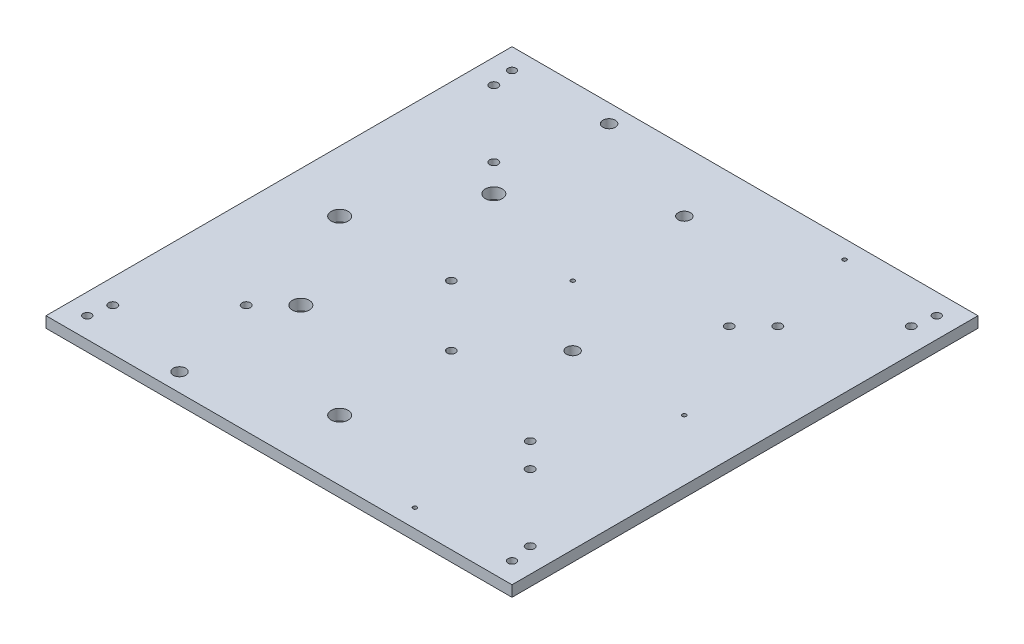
ISO-10303-21;
HEADER;
FILE_DESCRIPTION(('STEP AP214'),'2;1');
FILE_NAME('part.step','',(''),(''),'','','');
FILE_SCHEMA(('AUTOMOTIVE_DESIGN { 1 0 10303 214 1 1 1 1 }'));
ENDSEC;
DATA;
#1=APPLICATION_CONTEXT('core data for automotive mechanical design processes');
#2=APPLICATION_PROTOCOL_DEFINITION('international standard','automotive_design',2000,#1);
#3=PRODUCT_CONTEXT('',#1,'mechanical');
#4=PRODUCT('Part','Part','',(#3));
#5=PRODUCT_RELATED_PRODUCT_CATEGORY('part','',(#4));
#6=PRODUCT_DEFINITION_FORMATION('','',#4);
#7=PRODUCT_DEFINITION_CONTEXT('part definition',#1,'design');
#8=PRODUCT_DEFINITION('design','',#6,#7);
#9=PRODUCT_DEFINITION_SHAPE('','',#8);
#10=(LENGTH_UNIT() NAMED_UNIT(*) SI_UNIT(.MILLI.,.METRE.));
#11=(NAMED_UNIT(*) PLANE_ANGLE_UNIT() SI_UNIT($,.RADIAN.));
#12=(NAMED_UNIT(*) SI_UNIT($,.STERADIAN.) SOLID_ANGLE_UNIT());
#13=UNCERTAINTY_MEASURE_WITH_UNIT(LENGTH_MEASURE(1.E-05),#10,'distance_accuracy_value','');
#14=(GEOMETRIC_REPRESENTATION_CONTEXT(3) GLOBAL_UNCERTAINTY_ASSIGNED_CONTEXT((#13)) GLOBAL_UNIT_ASSIGNED_CONTEXT((#10,
#11,#12)) REPRESENTATION_CONTEXT('',''));
#15=CARTESIAN_POINT('',(0.,0.,0.));
#16=DIRECTION('',(0.,0.,1.));
#17=DIRECTION('',(1.,0.,0.));
#18=AXIS2_PLACEMENT_3D('',#15,#16,#17);
#19=CARTESIAN_POINT('',(0.,0.,0.));
#20=DIRECTION('',(0.,-1.,0.));
#21=DIRECTION('',(0.,0.,-1.));
#22=AXIS2_PLACEMENT_3D('',#19,#20,#21);
#23=PLANE('',#22);
#24=CARTESIAN_POINT('',(50.,0.,-192.));
#25=DIRECTION('',(0.,1.,0.));
#26=DIRECTION('',(0.,0.,1.));
#27=AXIS2_PLACEMENT_3D('',#24,#25,#26);
#28=CIRCLE('',#27,7.);
#29=CARTESIAN_POINT('',(50.,0.,-185.));
#30=VERTEX_POINT('',#29);
#31=EDGE_CURVE('E289',#30,#30,#28,.T.);
#32=ORIENTED_EDGE('',*,*,#31,.T.);
#33=EDGE_LOOP('',(#32));
#34=FACE_BOUND('',#33,.T.);
#35=CARTESIAN_POINT('',(97.5,0.,-271.5));
#36=DIRECTION('',(0.,1.,0.));
#37=DIRECTION('',(0.,0.,1.));
#38=AXIS2_PLACEMENT_3D('',#35,#36,#37);
#39=CIRCLE('',#38,6.99999999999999);
#40=CARTESIAN_POINT('',(97.5,0.,-264.5));
#41=VERTEX_POINT('',#40);
#42=EDGE_CURVE('E281',#41,#41,#39,.T.);
#43=ORIENTED_EDGE('',*,*,#42,.T.);
#44=EDGE_LOOP('',(#43));
#45=FACE_BOUND('',#44,.T.);
#46=CARTESIAN_POINT('',(192.,0.,-50.));
#47=DIRECTION('',(0.,1.,0.));
#48=DIRECTION('',(0.,0.,1.));
#49=AXIS2_PLACEMENT_3D('',#46,#47,#48);
#50=CIRCLE('',#49,7.00000000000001);
#51=CARTESIAN_POINT('',(192.,0.,-43.));
#52=VERTEX_POINT('',#51);
#53=EDGE_CURVE('E273',#52,#52,#50,.T.);
#54=ORIENTED_EDGE('',*,*,#53,.T.);
#55=EDGE_LOOP('',(#54));
#56=FACE_BOUND('',#55,.T.);
#57=CARTESIAN_POINT('',(97.5,0.,-112.5));
#58=DIRECTION('',(0.,1.,0.));
#59=DIRECTION('',(0.,0.,1.));
#60=AXIS2_PLACEMENT_3D('',#57,#58,#59);
#61=CIRCLE('',#60,6.99999999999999);
#62=CARTESIAN_POINT('',(97.5,0.,-105.5));
#63=VERTEX_POINT('',#62);
#64=EDGE_CURVE('E265',#63,#63,#61,.T.);
#65=ORIENTED_EDGE('',*,*,#64,.T.);
#66=EDGE_LOOP('',(#65));
#67=FACE_BOUND('',#66,.T.);
#68=CARTESIAN_POINT('',(242.,0.,-192.));
#69=DIRECTION('',(0.,1.,0.));
#70=DIRECTION('',(0.,0.,1.));
#71=AXIS2_PLACEMENT_3D('',#68,#69,#70);
#72=CIRCLE('',#71,5.09999999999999);
#73=CARTESIAN_POINT('',(242.,0.,-186.9));
#74=VERTEX_POINT('',#73);
#75=EDGE_CURVE('E257',#74,#74,#72,.T.);
#76=ORIENTED_EDGE('',*,*,#75,.T.);
#77=EDGE_LOOP('',(#76));
#78=FACE_BOUND('',#77,.T.);
#79=CARTESIAN_POINT('',(192.,0.,-334.));
#80=DIRECTION('',(0.,1.,0.));
#81=DIRECTION('',(0.,0.,1.));
#82=AXIS2_PLACEMENT_3D('',#79,#80,#81);
#83=CIRCLE('',#82,5.09999999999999);
#84=CARTESIAN_POINT('',(192.,0.,-328.9));
#85=VERTEX_POINT('',#84);
#86=EDGE_CURVE('E249',#85,#85,#83,.T.);
#87=ORIENTED_EDGE('',*,*,#86,.T.);
#88=EDGE_LOOP('',(#87));
#89=FACE_BOUND('',#88,.T.);
#90=CARTESIAN_POINT('',(95.,0.,-369.));
#91=DIRECTION('',(0.,1.,0.));
#92=DIRECTION('',(0.,0.,1.));
#93=AXIS2_PLACEMENT_3D('',#90,#91,#92);
#94=CIRCLE('',#93,5.09999999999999);
#95=CARTESIAN_POINT('',(95.,0.,-363.9));
#96=VERTEX_POINT('',#95);
#97=EDGE_CURVE('E241',#96,#96,#94,.T.);
#98=ORIENTED_EDGE('',*,*,#97,.T.);
#99=EDGE_LOOP('',(#98));
#100=FACE_BOUND('',#99,.T.);
#101=CARTESIAN_POINT('',(95.,0.,-15.));
#102=DIRECTION('',(0.,1.,0.));
#103=DIRECTION('',(0.,0.,1.));
#104=AXIS2_PLACEMENT_3D('',#101,#102,#103);
#105=CIRCLE('',#104,5.09999999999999);
#106=CARTESIAN_POINT('',(95.,0.,-9.90000000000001));
#107=VERTEX_POINT('',#106);
#108=EDGE_CURVE('E233',#107,#107,#105,.T.);
#109=ORIENTED_EDGE('',*,*,#108,.T.);
#110=EDGE_LOOP('',(#109));
#111=FACE_BOUND('',#110,.T.);
#112=CARTESIAN_POINT('',(192.,0.,-242.));
#113=DIRECTION('',(0.,1.,0.));
#114=DIRECTION('',(0.,0.,1.));
#115=AXIS2_PLACEMENT_3D('',#112,#113,#114);
#116=CIRCLE('',#115,1.64999999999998);
#117=CARTESIAN_POINT('',(192.,0.,-240.35));
#118=VERTEX_POINT('',#117);
#119=EDGE_CURVE('E225',#118,#118,#116,.T.);
#120=ORIENTED_EDGE('',*,*,#119,.T.);
#121=EDGE_LOOP('',(#120));
#122=FACE_BOUND('',#121,.T.);
#123=CARTESIAN_POINT('',(334.,0.,-192.));
#124=DIRECTION('',(0.,1.,0.));
#125=DIRECTION('',(0.,0.,1.));
#126=AXIS2_PLACEMENT_3D('',#123,#124,#125);
#127=CIRCLE('',#126,1.64999999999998);
#128=CARTESIAN_POINT('',(334.,0.,-190.35));
#129=VERTEX_POINT('',#128);
#130=EDGE_CURVE('E217',#129,#129,#127,.T.);
#131=ORIENTED_EDGE('',*,*,#130,.T.);
#132=EDGE_LOOP('',(#131));
#133=FACE_BOUND('',#132,.T.);
#134=CARTESIAN_POINT('',(289.,0.,-369.));
#135=DIRECTION('',(0.,1.,0.));
#136=DIRECTION('',(0.,0.,1.));
#137=AXIS2_PLACEMENT_3D('',#134,#135,#136);
#138=CIRCLE('',#137,1.64999999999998);
#139=CARTESIAN_POINT('',(289.,0.,-367.35));
#140=VERTEX_POINT('',#139);
#141=EDGE_CURVE('E209',#140,#140,#138,.T.);
#142=ORIENTED_EDGE('',*,*,#141,.T.);
#143=EDGE_LOOP('',(#142));
#144=FACE_BOUND('',#143,.T.);
#145=CARTESIAN_POINT('',(289.,0.,-15.));
#146=DIRECTION('',(0.,1.,0.));
#147=DIRECTION('',(0.,0.,1.));
#148=AXIS2_PLACEMENT_3D('',#145,#146,#147);
#149=CIRCLE('',#148,1.64999999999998);
#150=CARTESIAN_POINT('',(289.,0.,-13.35));
#151=VERTEX_POINT('',#150);
#152=EDGE_CURVE('E201',#151,#151,#149,.T.);
#153=ORIENTED_EDGE('',*,*,#152,.T.);
#154=EDGE_LOOP('',(#153));
#155=FACE_BOUND('',#154,.T.);
#156=CARTESIAN_POINT('',(142.,0.,-192.));
#157=DIRECTION('',(0.,1.,0.));
#158=DIRECTION('',(0.,0.,1.));
#159=AXIS2_PLACEMENT_3D('',#156,#157,#158);
#160=CIRCLE('',#159,3.39999999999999);
#161=CARTESIAN_POINT('',(142.,0.,-188.6));
#162=VERTEX_POINT('',#161);
#163=EDGE_CURVE('E193',#162,#162,#160,.T.);
#164=ORIENTED_EDGE('',*,*,#163,.T.);
#165=EDGE_LOOP('',(#164));
#166=FACE_BOUND('',#165,.T.);
#167=CARTESIAN_POINT('',(289.,0.,-110.));
#168=DIRECTION('',(0.,1.,0.));
#169=DIRECTION('',(0.,0.,1.));
#170=AXIS2_PLACEMENT_3D('',#167,#168,#169);
#171=CIRCLE('',#170,3.40000000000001);
#172=CARTESIAN_POINT('',(289.,0.,-106.6));
#173=VERTEX_POINT('',#172);
#174=EDGE_CURVE('E185',#173,#173,#171,.T.);
#175=ORIENTED_EDGE('',*,*,#174,.T.);
#176=EDGE_LOOP('',(#175));
#177=FACE_BOUND('',#176,.T.);
#178=CARTESIAN_POINT('',(289.,0.,-274.));
#179=DIRECTION('',(0.,1.,0.));
#180=DIRECTION('',(0.,0.,1.));
#181=AXIS2_PLACEMENT_3D('',#178,#179,#180);
#182=CIRCLE('',#181,3.40000000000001);
#183=CARTESIAN_POINT('',(289.,0.,-270.6));
#184=VERTEX_POINT('',#183);
#185=EDGE_CURVE('E177',#184,#184,#182,.T.);
#186=ORIENTED_EDGE('',*,*,#185,.T.);
#187=EDGE_LOOP('',(#186));
#188=FACE_BOUND('',#187,.T.);
#189=CARTESIAN_POINT('',(192.,0.,-142.));
#190=DIRECTION('',(0.,1.,0.));
#191=DIRECTION('',(0.,0.,1.));
#192=AXIS2_PLACEMENT_3D('',#189,#190,#191);
#193=CIRCLE('',#192,3.39999999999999);
#194=CARTESIAN_POINT('',(192.,0.,-138.6));
#195=VERTEX_POINT('',#194);
#196=EDGE_CURVE('E169',#195,#195,#193,.T.);
#197=ORIENTED_EDGE('',*,*,#196,.T.);
#198=EDGE_LOOP('',(#197));
#199=FACE_BOUND('',#198,.T.);
#200=CARTESIAN_POINT('',(17.,0.,-17.));
#201=DIRECTION('',(0.,-1.,0.));
#202=DIRECTION('',(0.,0.,-1.));
#203=AXIS2_PLACEMENT_3D('',#200,#201,#202);
#204=CIRCLE('',#203,3.29999999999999);
#205=CARTESIAN_POINT('',(17.,0.,-20.3));
#206=VERTEX_POINT('',#205);
#207=EDGE_CURVE('E161',#206,#206,#204,.T.);
#208=ORIENTED_EDGE('',*,*,#207,.F.);
#209=EDGE_LOOP('',(#208));
#210=FACE_BOUND('',#209,.T.);
#211=CARTESIAN_POINT('',(17.,0.,-367.));
#212=DIRECTION('',(0.,-1.,0.));
#213=DIRECTION('',(0.,0.,-1.));
#214=AXIS2_PLACEMENT_3D('',#211,#212,#213);
#215=CIRCLE('',#214,3.29999999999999);
#216=CARTESIAN_POINT('',(17.,0.,-370.3));
#217=VERTEX_POINT('',#216);
#218=EDGE_CURVE('E153',#217,#217,#215,.T.);
#219=ORIENTED_EDGE('',*,*,#218,.F.);
#220=EDGE_LOOP('',(#219));
#221=FACE_BOUND('',#220,.T.);
#222=CARTESIAN_POINT('',(367.,0.,-367.));
#223=DIRECTION('',(0.,-1.,0.));
#224=DIRECTION('',(0.,0.,-1.));
#225=AXIS2_PLACEMENT_3D('',#222,#223,#224);
#226=CIRCLE('',#225,3.3);
#227=CARTESIAN_POINT('',(367.,0.,-370.3));
#228=VERTEX_POINT('',#227);
#229=EDGE_CURVE('E145',#228,#228,#226,.T.);
#230=ORIENTED_EDGE('',*,*,#229,.F.);
#231=EDGE_LOOP('',(#230));
#232=FACE_BOUND('',#231,.T.);
#233=CARTESIAN_POINT('',(367.,0.,-17.));
#234=DIRECTION('',(0.,-1.,0.));
#235=DIRECTION('',(0.,0.,-1.));
#236=AXIS2_PLACEMENT_3D('',#233,#234,#235);
#237=CIRCLE('',#236,3.3);
#238=CARTESIAN_POINT('',(367.,0.,-20.3));
#239=VERTEX_POINT('',#238);
#240=EDGE_CURVE('E121',#239,#239,#237,.T.);
#241=ORIENTED_EDGE('',*,*,#240,.F.);
#242=EDGE_LOOP('',(#241));
#243=FACE_BOUND('',#242,.T.);
#244=DIRECTION('',(0.,0.,1.));
#245=VECTOR('',#244,1.);
#246=CARTESIAN_POINT('',(0.,0.,0.));
#247=LINE('',#246,#245);
#248=CARTESIAN_POINT('',(0.,0.,-384.));
#249=VERTEX_POINT('',#248);
#250=CARTESIAN_POINT('',(0.,0.,0.));
#251=VERTEX_POINT('',#250);
#252=EDGE_CURVE('E117',#249,#251,#247,.T.);
#253=ORIENTED_EDGE('',*,*,#252,.F.);
#254=DIRECTION('',(-1.,0.,0.));
#255=VECTOR('',#254,1.);
#256=CARTESIAN_POINT('',(0.,0.,-384.));
#257=LINE('',#256,#255);
#258=CARTESIAN_POINT('',(384.,0.,-384.));
#259=VERTEX_POINT('',#258);
#260=EDGE_CURVE('E88',#259,#249,#257,.T.);
#261=ORIENTED_EDGE('',*,*,#260,.F.);
#262=DIRECTION('',(0.,0.,-1.));
#263=VECTOR('',#262,1.);
#264=CARTESIAN_POINT('',(384.,0.,0.));
#265=LINE('',#264,#263);
#266=CARTESIAN_POINT('',(384.,0.,0.));
#267=VERTEX_POINT('',#266);
#268=EDGE_CURVE('E82',#267,#259,#265,.T.);
#269=ORIENTED_EDGE('',*,*,#268,.F.);
#270=DIRECTION('',(1.,0.,0.));
#271=VECTOR('',#270,1.);
#272=CARTESIAN_POINT('',(0.,0.,0.));
#273=LINE('',#272,#271);
#274=EDGE_CURVE('E106',#251,#267,#273,.T.);
#275=ORIENTED_EDGE('',*,*,#274,.F.);
#276=EDGE_LOOP('',(#253,#261,#269,#275));
#277=FACE_BOUND('',#276,.T.);
#278=CARTESIAN_POINT('',(75.0000000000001,0.,-90.));
#279=DIRECTION('',(0.,1.,0.));
#280=DIRECTION('',(0.,0.,1.));
#281=AXIS2_PLACEMENT_3D('',#278,#279,#280);
#282=CIRCLE('',#281,3.5);
#283=CARTESIAN_POINT('',(75.0000000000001,0.,-86.5));
#284=VERTEX_POINT('',#283);
#285=EDGE_CURVE('E297',#284,#284,#282,.T.);
#286=ORIENTED_EDGE('',*,*,#285,.T.);
#287=EDGE_LOOP('',(#286));
#288=FACE_BOUND('',#287,.T.);
#289=CARTESIAN_POINT('',(20.0000000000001,0.,-35.));
#290=DIRECTION('',(0.,1.,0.));
#291=DIRECTION('',(0.,0.,1.));
#292=AXIS2_PLACEMENT_3D('',#289,#290,#291);
#293=CIRCLE('',#292,3.5);
#294=CARTESIAN_POINT('',(20.0000000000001,0.,-31.5));
#295=VERTEX_POINT('',#294);
#296=EDGE_CURVE('E305',#295,#295,#293,.T.);
#297=ORIENTED_EDGE('',*,*,#296,.T.);
#298=EDGE_LOOP('',(#297));
#299=FACE_BOUND('',#298,.T.);
#300=CARTESIAN_POINT('',(309.,0.,-90.0000000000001));
#301=DIRECTION('',(0.,1.,0.));
#302=DIRECTION('',(0.,0.,1.));
#303=AXIS2_PLACEMENT_3D('',#300,#301,#302);
#304=CIRCLE('',#303,3.5);
#305=CARTESIAN_POINT('',(309.,0.,-86.5));
#306=VERTEX_POINT('',#305);
#307=EDGE_CURVE('E313',#306,#306,#304,.T.);
#308=ORIENTED_EDGE('',*,*,#307,.T.);
#309=EDGE_LOOP('',(#308));
#310=FACE_BOUND('',#309,.T.);
#311=CARTESIAN_POINT('',(364.,0.,-35.0000000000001));
#312=DIRECTION('',(0.,1.,0.));
#313=DIRECTION('',(0.,0.,1.));
#314=AXIS2_PLACEMENT_3D('',#311,#312,#313);
#315=CIRCLE('',#314,3.5);
#316=CARTESIAN_POINT('',(364.,0.,-31.5000000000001));
#317=VERTEX_POINT('',#316);
#318=EDGE_CURVE('E321',#317,#317,#315,.T.);
#319=ORIENTED_EDGE('',*,*,#318,.T.);
#320=EDGE_LOOP('',(#319));
#321=FACE_BOUND('',#320,.T.);
#322=CARTESIAN_POINT('',(309.,0.,-294.));
#323=DIRECTION('',(0.,1.,0.));
#324=DIRECTION('',(0.,0.,1.));
#325=AXIS2_PLACEMENT_3D('',#322,#323,#324);
#326=CIRCLE('',#325,3.5);
#327=CARTESIAN_POINT('',(309.,0.,-290.5));
#328=VERTEX_POINT('',#327);
#329=EDGE_CURVE('E329',#328,#328,#326,.T.);
#330=ORIENTED_EDGE('',*,*,#329,.T.);
#331=EDGE_LOOP('',(#330));
#332=FACE_BOUND('',#331,.T.);
#333=CARTESIAN_POINT('',(364.,0.,-349.));
#334=DIRECTION('',(0.,1.,0.));
#335=DIRECTION('',(0.,0.,1.));
#336=AXIS2_PLACEMENT_3D('',#333,#334,#335);
#337=CIRCLE('',#336,3.5);
#338=CARTESIAN_POINT('',(364.,0.,-345.5));
#339=VERTEX_POINT('',#338);
#340=EDGE_CURVE('E337',#339,#339,#337,.T.);
#341=ORIENTED_EDGE('',*,*,#340,.T.);
#342=EDGE_LOOP('',(#341));
#343=FACE_BOUND('',#342,.T.);
#344=CARTESIAN_POINT('',(75.,0.,-294.));
#345=DIRECTION('',(0.,1.,0.));
#346=DIRECTION('',(0.,0.,1.));
#347=AXIS2_PLACEMENT_3D('',#344,#345,#346);
#348=CIRCLE('',#347,3.5);
#349=CARTESIAN_POINT('',(75.,0.,-290.5));
#350=VERTEX_POINT('',#349);
#351=EDGE_CURVE('E345',#350,#350,#348,.T.);
#352=ORIENTED_EDGE('',*,*,#351,.T.);
#353=EDGE_LOOP('',(#352));
#354=FACE_BOUND('',#353,.T.);
#355=CARTESIAN_POINT('',(20.,0.,-349.));
#356=DIRECTION('',(0.,1.,0.));
#357=DIRECTION('',(0.,0.,1.));
#358=AXIS2_PLACEMENT_3D('',#355,#356,#357);
#359=CIRCLE('',#358,3.5);
#360=CARTESIAN_POINT('',(20.,0.,-345.5));
#361=VERTEX_POINT('',#360);
#362=EDGE_CURVE('E353',#361,#361,#359,.T.);
#363=ORIENTED_EDGE('',*,*,#362,.T.);
#364=EDGE_LOOP('',(#363));
#365=FACE_BOUND('',#364,.T.);
#366=ADVANCED_FACE('F47',(#34,#45,#56,#67,#78,#89,#100,#111,#122,#133,#144,#155,#166,#177,#188,
#199,#210,#221,#232,#243,#277,#288,#299,#310,#321,#332,#343,#354,#365),#23,.T.);
#367=CARTESIAN_POINT('',(0.,8.99,0.));
#368=DIRECTION('',(0.,-1.,0.));
#369=DIRECTION('',(0.,0.,-1.));
#370=AXIS2_PLACEMENT_3D('',#367,#368,#369);
#371=PLANE('',#370);
#372=CARTESIAN_POINT('',(20.,8.99,-349.));
#373=DIRECTION('',(0.,1.,0.));
#374=DIRECTION('',(0.,0.,1.));
#375=AXIS2_PLACEMENT_3D('',#372,#373,#374);
#376=CIRCLE('',#375,3.5);
#377=CARTESIAN_POINT('',(20.,8.99,-345.5));
#378=VERTEX_POINT('',#377);
#379=EDGE_CURVE('E357',#378,#378,#376,.T.);
#380=ORIENTED_EDGE('',*,*,#379,.F.);
#381=EDGE_LOOP('',(#380));
#382=FACE_BOUND('',#381,.T.);
#383=CARTESIAN_POINT('',(75.,8.99,-294.));
#384=DIRECTION('',(0.,1.,0.));
#385=DIRECTION('',(0.,0.,1.));
#386=AXIS2_PLACEMENT_3D('',#383,#384,#385);
#387=CIRCLE('',#386,3.5);
#388=CARTESIAN_POINT('',(75.,8.99,-290.5));
#389=VERTEX_POINT('',#388);
#390=EDGE_CURVE('E349',#389,#389,#387,.T.);
#391=ORIENTED_EDGE('',*,*,#390,.F.);
#392=EDGE_LOOP('',(#391));
#393=FACE_BOUND('',#392,.T.);
#394=CARTESIAN_POINT('',(364.,8.99,-349.));
#395=DIRECTION('',(0.,1.,0.));
#396=DIRECTION('',(0.,0.,1.));
#397=AXIS2_PLACEMENT_3D('',#394,#395,#396);
#398=CIRCLE('',#397,3.5);
#399=CARTESIAN_POINT('',(364.,8.99,-345.5));
#400=VERTEX_POINT('',#399);
#401=EDGE_CURVE('E341',#400,#400,#398,.T.);
#402=ORIENTED_EDGE('',*,*,#401,.F.);
#403=EDGE_LOOP('',(#402));
#404=FACE_BOUND('',#403,.T.);
#405=CARTESIAN_POINT('',(309.,8.99,-294.));
#406=DIRECTION('',(0.,1.,0.));
#407=DIRECTION('',(0.,0.,1.));
#408=AXIS2_PLACEMENT_3D('',#405,#406,#407);
#409=CIRCLE('',#408,3.5);
#410=CARTESIAN_POINT('',(309.,8.99,-290.5));
#411=VERTEX_POINT('',#410);
#412=EDGE_CURVE('E333',#411,#411,#409,.T.);
#413=ORIENTED_EDGE('',*,*,#412,.F.);
#414=EDGE_LOOP('',(#413));
#415=FACE_BOUND('',#414,.T.);
#416=CARTESIAN_POINT('',(364.,8.99,-35.0000000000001));
#417=DIRECTION('',(0.,1.,0.));
#418=DIRECTION('',(0.,0.,1.));
#419=AXIS2_PLACEMENT_3D('',#416,#417,#418);
#420=CIRCLE('',#419,3.5);
#421=CARTESIAN_POINT('',(364.,8.99,-31.5000000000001));
#422=VERTEX_POINT('',#421);
#423=EDGE_CURVE('E325',#422,#422,#420,.T.);
#424=ORIENTED_EDGE('',*,*,#423,.F.);
#425=EDGE_LOOP('',(#424));
#426=FACE_BOUND('',#425,.T.);
#427=CARTESIAN_POINT('',(309.,8.99,-90.0000000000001));
#428=DIRECTION('',(0.,1.,0.));
#429=DIRECTION('',(0.,0.,1.));
#430=AXIS2_PLACEMENT_3D('',#427,#428,#429);
#431=CIRCLE('',#430,3.5);
#432=CARTESIAN_POINT('',(309.,8.99,-86.5));
#433=VERTEX_POINT('',#432);
#434=EDGE_CURVE('E317',#433,#433,#431,.T.);
#435=ORIENTED_EDGE('',*,*,#434,.F.);
#436=EDGE_LOOP('',(#435));
#437=FACE_BOUND('',#436,.T.);
#438=CARTESIAN_POINT('',(20.0000000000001,8.99,-35.));
#439=DIRECTION('',(0.,1.,0.));
#440=DIRECTION('',(0.,0.,1.));
#441=AXIS2_PLACEMENT_3D('',#438,#439,#440);
#442=CIRCLE('',#441,3.5);
#443=CARTESIAN_POINT('',(20.0000000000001,8.99,-31.5));
#444=VERTEX_POINT('',#443);
#445=EDGE_CURVE('E309',#444,#444,#442,.T.);
#446=ORIENTED_EDGE('',*,*,#445,.F.);
#447=EDGE_LOOP('',(#446));
#448=FACE_BOUND('',#447,.T.);
#449=CARTESIAN_POINT('',(75.0000000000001,8.99,-90.));
#450=DIRECTION('',(0.,1.,0.));
#451=DIRECTION('',(0.,0.,1.));
#452=AXIS2_PLACEMENT_3D('',#449,#450,#451);
#453=CIRCLE('',#452,3.5);
#454=CARTESIAN_POINT('',(75.0000000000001,8.99,-86.5));
#455=VERTEX_POINT('',#454);
#456=EDGE_CURVE('E301',#455,#455,#453,.T.);
#457=ORIENTED_EDGE('',*,*,#456,.F.);
#458=EDGE_LOOP('',(#457));
#459=FACE_BOUND('',#458,.T.);
#460=CARTESIAN_POINT('',(50.,8.99,-192.));
#461=DIRECTION('',(0.,1.,0.));
#462=DIRECTION('',(0.,0.,1.));
#463=AXIS2_PLACEMENT_3D('',#460,#461,#462);
#464=CIRCLE('',#463,7.);
#465=CARTESIAN_POINT('',(50.,8.99,-185.));
#466=VERTEX_POINT('',#465);
#467=EDGE_CURVE('E293',#466,#466,#464,.T.);
#468=ORIENTED_EDGE('',*,*,#467,.F.);
#469=EDGE_LOOP('',(#468));
#470=FACE_BOUND('',#469,.T.);
#471=CARTESIAN_POINT('',(97.5,8.99,-271.5));
#472=DIRECTION('',(0.,1.,0.));
#473=DIRECTION('',(0.,0.,1.));
#474=AXIS2_PLACEMENT_3D('',#471,#472,#473);
#475=CIRCLE('',#474,7.00000000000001);
#476=CARTESIAN_POINT('',(97.5,8.99,-264.5));
#477=VERTEX_POINT('',#476);
#478=EDGE_CURVE('E285',#477,#477,#475,.T.);
#479=ORIENTED_EDGE('',*,*,#478,.F.);
#480=EDGE_LOOP('',(#479));
#481=FACE_BOUND('',#480,.T.);
#482=CARTESIAN_POINT('',(192.,8.99,-50.));
#483=DIRECTION('',(0.,1.,0.));
#484=DIRECTION('',(0.,0.,1.));
#485=AXIS2_PLACEMENT_3D('',#482,#483,#484);
#486=CIRCLE('',#485,7.00000000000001);
#487=CARTESIAN_POINT('',(192.,8.99,-43.));
#488=VERTEX_POINT('',#487);
#489=EDGE_CURVE('E277',#488,#488,#486,.T.);
#490=ORIENTED_EDGE('',*,*,#489,.F.);
#491=EDGE_LOOP('',(#490));
#492=FACE_BOUND('',#491,.T.);
#493=CARTESIAN_POINT('',(97.5,8.99,-112.5));
#494=DIRECTION('',(0.,1.,0.));
#495=DIRECTION('',(0.,0.,1.));
#496=AXIS2_PLACEMENT_3D('',#493,#494,#495);
#497=CIRCLE('',#496,7.00000000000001);
#498=CARTESIAN_POINT('',(97.5,8.99,-105.5));
#499=VERTEX_POINT('',#498);
#500=EDGE_CURVE('E269',#499,#499,#497,.T.);
#501=ORIENTED_EDGE('',*,*,#500,.F.);
#502=EDGE_LOOP('',(#501));
#503=FACE_BOUND('',#502,.T.);
#504=CARTESIAN_POINT('',(242.,8.99,-192.));
#505=DIRECTION('',(0.,1.,0.));
#506=DIRECTION('',(0.,0.,1.));
#507=AXIS2_PLACEMENT_3D('',#504,#505,#506);
#508=CIRCLE('',#507,5.09999999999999);
#509=CARTESIAN_POINT('',(242.,8.99,-186.9));
#510=VERTEX_POINT('',#509);
#511=EDGE_CURVE('E261',#510,#510,#508,.T.);
#512=ORIENTED_EDGE('',*,*,#511,.F.);
#513=EDGE_LOOP('',(#512));
#514=FACE_BOUND('',#513,.T.);
#515=CARTESIAN_POINT('',(192.,8.99,-334.));
#516=DIRECTION('',(0.,1.,0.));
#517=DIRECTION('',(0.,0.,1.));
#518=AXIS2_PLACEMENT_3D('',#515,#516,#517);
#519=CIRCLE('',#518,5.09999999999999);
#520=CARTESIAN_POINT('',(192.,8.99,-328.9));
#521=VERTEX_POINT('',#520);
#522=EDGE_CURVE('E253',#521,#521,#519,.T.);
#523=ORIENTED_EDGE('',*,*,#522,.F.);
#524=EDGE_LOOP('',(#523));
#525=FACE_BOUND('',#524,.T.);
#526=CARTESIAN_POINT('',(95.,8.99,-369.));
#527=DIRECTION('',(0.,1.,0.));
#528=DIRECTION('',(0.,0.,1.));
#529=AXIS2_PLACEMENT_3D('',#526,#527,#528);
#530=CIRCLE('',#529,5.09999999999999);
#531=CARTESIAN_POINT('',(95.,8.99,-363.9));
#532=VERTEX_POINT('',#531);
#533=EDGE_CURVE('E245',#532,#532,#530,.T.);
#534=ORIENTED_EDGE('',*,*,#533,.F.);
#535=EDGE_LOOP('',(#534));
#536=FACE_BOUND('',#535,.T.);
#537=CARTESIAN_POINT('',(95.,8.99,-15.));
#538=DIRECTION('',(0.,1.,0.));
#539=DIRECTION('',(0.,0.,1.));
#540=AXIS2_PLACEMENT_3D('',#537,#538,#539);
#541=CIRCLE('',#540,5.09999999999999);
#542=CARTESIAN_POINT('',(95.,8.99,-9.90000000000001));
#543=VERTEX_POINT('',#542);
#544=EDGE_CURVE('E237',#543,#543,#541,.T.);
#545=ORIENTED_EDGE('',*,*,#544,.F.);
#546=EDGE_LOOP('',(#545));
#547=FACE_BOUND('',#546,.T.);
#548=CARTESIAN_POINT('',(192.,8.99,-242.));
#549=DIRECTION('',(0.,1.,0.));
#550=DIRECTION('',(0.,0.,1.));
#551=AXIS2_PLACEMENT_3D('',#548,#549,#550);
#552=CIRCLE('',#551,1.65000000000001);
#553=CARTESIAN_POINT('',(192.,8.99,-240.35));
#554=VERTEX_POINT('',#553);
#555=EDGE_CURVE('E229',#554,#554,#552,.T.);
#556=ORIENTED_EDGE('',*,*,#555,.F.);
#557=EDGE_LOOP('',(#556));
#558=FACE_BOUND('',#557,.T.);
#559=CARTESIAN_POINT('',(334.,8.99,-192.));
#560=DIRECTION('',(0.,1.,0.));
#561=DIRECTION('',(0.,0.,1.));
#562=AXIS2_PLACEMENT_3D('',#559,#560,#561);
#563=CIRCLE('',#562,1.64999999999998);
#564=CARTESIAN_POINT('',(334.,8.99,-190.35));
#565=VERTEX_POINT('',#564);
#566=EDGE_CURVE('E221',#565,#565,#563,.T.);
#567=ORIENTED_EDGE('',*,*,#566,.F.);
#568=EDGE_LOOP('',(#567));
#569=FACE_BOUND('',#568,.T.);
#570=CARTESIAN_POINT('',(289.,8.99,-369.));
#571=DIRECTION('',(0.,1.,0.));
#572=DIRECTION('',(0.,0.,1.));
#573=AXIS2_PLACEMENT_3D('',#570,#571,#572);
#574=CIRCLE('',#573,1.64999999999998);
#575=CARTESIAN_POINT('',(289.,8.99,-367.35));
#576=VERTEX_POINT('',#575);
#577=EDGE_CURVE('E213',#576,#576,#574,.T.);
#578=ORIENTED_EDGE('',*,*,#577,.F.);
#579=EDGE_LOOP('',(#578));
#580=FACE_BOUND('',#579,.T.);
#581=CARTESIAN_POINT('',(289.,8.99,-15.));
#582=DIRECTION('',(0.,1.,0.));
#583=DIRECTION('',(0.,0.,1.));
#584=AXIS2_PLACEMENT_3D('',#581,#582,#583);
#585=CIRCLE('',#584,1.64999999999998);
#586=CARTESIAN_POINT('',(289.,8.99,-13.35));
#587=VERTEX_POINT('',#586);
#588=EDGE_CURVE('E205',#587,#587,#585,.T.);
#589=ORIENTED_EDGE('',*,*,#588,.F.);
#590=EDGE_LOOP('',(#589));
#591=FACE_BOUND('',#590,.T.);
#592=CARTESIAN_POINT('',(142.,8.99,-192.));
#593=DIRECTION('',(0.,1.,0.));
#594=DIRECTION('',(0.,0.,1.));
#595=AXIS2_PLACEMENT_3D('',#592,#593,#594);
#596=CIRCLE('',#595,3.39999999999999);
#597=CARTESIAN_POINT('',(142.,8.99,-188.6));
#598=VERTEX_POINT('',#597);
#599=EDGE_CURVE('E197',#598,#598,#596,.T.);
#600=ORIENTED_EDGE('',*,*,#599,.F.);
#601=EDGE_LOOP('',(#600));
#602=FACE_BOUND('',#601,.T.);
#603=CARTESIAN_POINT('',(289.,8.99,-110.));
#604=DIRECTION('',(0.,1.,0.));
#605=DIRECTION('',(0.,0.,1.));
#606=AXIS2_PLACEMENT_3D('',#603,#604,#605);
#607=CIRCLE('',#606,3.40000000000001);
#608=CARTESIAN_POINT('',(289.,8.99,-106.6));
#609=VERTEX_POINT('',#608);
#610=EDGE_CURVE('E189',#609,#609,#607,.T.);
#611=ORIENTED_EDGE('',*,*,#610,.F.);
#612=EDGE_LOOP('',(#611));
#613=FACE_BOUND('',#612,.T.);
#614=CARTESIAN_POINT('',(289.,8.99,-274.));
#615=DIRECTION('',(0.,1.,0.));
#616=DIRECTION('',(0.,0.,1.));
#617=AXIS2_PLACEMENT_3D('',#614,#615,#616);
#618=CIRCLE('',#617,3.40000000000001);
#619=CARTESIAN_POINT('',(289.,8.99,-270.6));
#620=VERTEX_POINT('',#619);
#621=EDGE_CURVE('E181',#620,#620,#618,.T.);
#622=ORIENTED_EDGE('',*,*,#621,.F.);
#623=EDGE_LOOP('',(#622));
#624=FACE_BOUND('',#623,.T.);
#625=CARTESIAN_POINT('',(192.,8.99,-142.));
#626=DIRECTION('',(0.,1.,0.));
#627=DIRECTION('',(0.,0.,1.));
#628=AXIS2_PLACEMENT_3D('',#625,#626,#627);
#629=CIRCLE('',#628,3.39999999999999);
#630=CARTESIAN_POINT('',(192.,8.99,-138.6));
#631=VERTEX_POINT('',#630);
#632=EDGE_CURVE('E173',#631,#631,#629,.T.);
#633=ORIENTED_EDGE('',*,*,#632,.F.);
#634=EDGE_LOOP('',(#633));
#635=FACE_BOUND('',#634,.T.);
#636=CARTESIAN_POINT('',(17.,8.99,-17.));
#637=DIRECTION('',(0.,1.,0.));
#638=DIRECTION('',(0.,0.,1.));
#639=AXIS2_PLACEMENT_3D('',#636,#637,#638);
#640=CIRCLE('',#639,3.29999999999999);
#641=CARTESIAN_POINT('',(17.,8.99,-13.7));
#642=VERTEX_POINT('',#641);
#643=EDGE_CURVE('E165',#642,#642,#640,.T.);
#644=ORIENTED_EDGE('',*,*,#643,.F.);
#645=EDGE_LOOP('',(#644));
#646=FACE_BOUND('',#645,.T.);
#647=CARTESIAN_POINT('',(367.,8.99,-367.));
#648=DIRECTION('',(0.,1.,0.));
#649=DIRECTION('',(0.,0.,1.));
#650=AXIS2_PLACEMENT_3D('',#647,#648,#649);
#651=CIRCLE('',#650,3.29999999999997);
#652=CARTESIAN_POINT('',(367.,8.99,-363.7));
#653=VERTEX_POINT('',#652);
#654=EDGE_CURVE('E149',#653,#653,#651,.T.);
#655=ORIENTED_EDGE('',*,*,#654,.F.);
#656=EDGE_LOOP('',(#655));
#657=FACE_BOUND('',#656,.T.);
#658=DIRECTION('',(0.,0.,1.));
#659=VECTOR('',#658,1.);
#660=CARTESIAN_POINT('',(0.,8.99,0.));
#661=LINE('',#660,#659);
#662=CARTESIAN_POINT('',(0.,8.99,-384.));
#663=VERTEX_POINT('',#662);
#664=CARTESIAN_POINT('',(0.,8.99,0.));
#665=VERTEX_POINT('',#664);
#666=EDGE_CURVE('E101',#663,#665,#661,.T.);
#667=ORIENTED_EDGE('',*,*,#666,.T.);
#668=DIRECTION('',(1.,0.,0.));
#669=VECTOR('',#668,1.);
#670=CARTESIAN_POINT('',(0.,8.99,0.));
#671=LINE('',#670,#669);
#672=CARTESIAN_POINT('',(384.,8.99,0.));
#673=VERTEX_POINT('',#672);
#674=EDGE_CURVE('E95',#665,#673,#671,.T.);
#675=ORIENTED_EDGE('',*,*,#674,.T.);
#676=DIRECTION('',(0.,0.,-1.));
#677=VECTOR('',#676,1.);
#678=CARTESIAN_POINT('',(384.,8.99,0.));
#679=LINE('',#678,#677);
#680=CARTESIAN_POINT('',(384.,8.99,-384.));
#681=VERTEX_POINT('',#680);
#682=EDGE_CURVE('E99',#673,#681,#679,.T.);
#683=ORIENTED_EDGE('',*,*,#682,.T.);
#684=DIRECTION('',(-1.,0.,0.));
#685=VECTOR('',#684,1.);
#686=CARTESIAN_POINT('',(0.,8.99,-384.));
#687=LINE('',#686,#685);
#688=EDGE_CURVE('E65',#681,#663,#687,.T.);
#689=ORIENTED_EDGE('',*,*,#688,.T.);
#690=EDGE_LOOP('',(#667,#675,#683,#689));
#691=FACE_BOUND('',#690,.T.);
#692=CARTESIAN_POINT('',(367.,8.99,-17.));
#693=DIRECTION('',(0.,1.,0.));
#694=DIRECTION('',(0.,0.,1.));
#695=AXIS2_PLACEMENT_3D('',#692,#693,#694);
#696=CIRCLE('',#695,3.29999999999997);
#697=CARTESIAN_POINT('',(367.,8.99,-13.7));
#698=VERTEX_POINT('',#697);
#699=EDGE_CURVE('E141',#698,#698,#696,.T.);
#700=ORIENTED_EDGE('',*,*,#699,.F.);
#701=EDGE_LOOP('',(#700));
#702=FACE_BOUND('',#701,.T.);
#703=CARTESIAN_POINT('',(17.,8.99,-367.));
#704=DIRECTION('',(0.,1.,0.));
#705=DIRECTION('',(0.,0.,1.));
#706=AXIS2_PLACEMENT_3D('',#703,#704,#705);
#707=CIRCLE('',#706,3.29999999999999);
#708=CARTESIAN_POINT('',(17.,8.99,-363.7));
#709=VERTEX_POINT('',#708);
#710=EDGE_CURVE('E157',#709,#709,#707,.T.);
#711=ORIENTED_EDGE('',*,*,#710,.F.);
#712=EDGE_LOOP('',(#711));
#713=FACE_BOUND('',#712,.T.);
#714=ADVANCED_FACE('F96',(#382,#393,#404,#415,#426,#437,#448,#459,#470,#481,#492,#503,#514,#525,
#536,#547,#558,#569,#580,#591,#602,#613,#624,#635,#646,#657,#691,#702,#713),#371,.F.);
#715=CARTESIAN_POINT('',(0.,8.99,0.));
#716=DIRECTION('',(1.,0.,0.));
#717=DIRECTION('',(0.,0.,-1.));
#718=AXIS2_PLACEMENT_3D('',#715,#716,#717);
#719=PLANE('',#718);
#720=ORIENTED_EDGE('',*,*,#252,.T.);
#721=DIRECTION('',(0.,-1.,0.));
#722=VECTOR('',#721,1.);
#723=CARTESIAN_POINT('',(0.,8.99,0.));
#724=LINE('',#723,#722);
#725=EDGE_CURVE('E11',#665,#251,#724,.T.);
#726=ORIENTED_EDGE('',*,*,#725,.F.);
#727=ORIENTED_EDGE('',*,*,#666,.F.);
#728=DIRECTION('',(0.,-1.,0.));
#729=VECTOR('',#728,1.);
#730=CARTESIAN_POINT('',(0.,8.99,-384.));
#731=LINE('',#730,#729);
#732=EDGE_CURVE('E113',#663,#249,#731,.T.);
#733=ORIENTED_EDGE('',*,*,#732,.T.);
#734=EDGE_LOOP('',(#720,#726,#727,#733));
#735=FACE_BOUND('',#734,.T.);
#736=ADVANCED_FACE('F49',(#735),#719,.F.);
#737=CARTESIAN_POINT('',(0.,8.99,0.));
#738=DIRECTION('',(0.,0.,-1.));
#739=DIRECTION('',(-1.,0.,0.));
#740=AXIS2_PLACEMENT_3D('',#737,#738,#739);
#741=PLANE('',#740);
#742=ORIENTED_EDGE('',*,*,#274,.T.);
#743=DIRECTION('',(0.,-1.,0.));
#744=VECTOR('',#743,1.);
#745=CARTESIAN_POINT('',(384.,8.99,0.));
#746=LINE('',#745,#744);
#747=EDGE_CURVE('E57',#673,#267,#746,.T.);
#748=ORIENTED_EDGE('',*,*,#747,.F.);
#749=ORIENTED_EDGE('',*,*,#674,.F.);
#750=ORIENTED_EDGE('',*,*,#725,.T.);
#751=EDGE_LOOP('',(#742,#748,#749,#750));
#752=FACE_BOUND('',#751,.T.);
#753=ADVANCED_FACE('F105',(#752),#741,.F.);
#754=CARTESIAN_POINT('',(384.,8.99,0.));
#755=DIRECTION('',(-1.,0.,0.));
#756=DIRECTION('',(0.,0.,1.));
#757=AXIS2_PLACEMENT_3D('',#754,#755,#756);
#758=PLANE('',#757);
#759=ORIENTED_EDGE('',*,*,#268,.T.);
#760=DIRECTION('',(0.,-1.,0.));
#761=VECTOR('',#760,1.);
#762=CARTESIAN_POINT('',(384.,8.99,-384.));
#763=LINE('',#762,#761);
#764=EDGE_CURVE('E108',#681,#259,#763,.T.);
#765=ORIENTED_EDGE('',*,*,#764,.F.);
#766=ORIENTED_EDGE('',*,*,#682,.F.);
#767=ORIENTED_EDGE('',*,*,#747,.T.);
#768=EDGE_LOOP('',(#759,#765,#766,#767));
#769=FACE_BOUND('',#768,.T.);
#770=ADVANCED_FACE('F109',(#769),#758,.F.);
#771=CARTESIAN_POINT('',(0.,8.99,-384.));
#772=DIRECTION('',(0.,0.,1.));
#773=DIRECTION('',(1.,0.,0.));
#774=AXIS2_PLACEMENT_3D('',#771,#772,#773);
#775=PLANE('',#774);
#776=ORIENTED_EDGE('',*,*,#260,.T.);
#777=ORIENTED_EDGE('',*,*,#732,.F.);
#778=ORIENTED_EDGE('',*,*,#688,.F.);
#779=ORIENTED_EDGE('',*,*,#764,.T.);
#780=EDGE_LOOP('',(#776,#777,#778,#779));
#781=FACE_BOUND('',#780,.T.);
#782=ADVANCED_FACE('F131',(#781),#775,.F.);
#783=CARTESIAN_POINT('',(367.,8.99,-17.));
#784=DIRECTION('',(0.,1.,0.));
#785=DIRECTION('',(0.,0.,1.));
#786=AXIS2_PLACEMENT_3D('',#783,#784,#785);
#787=CYLINDRICAL_SURFACE('',#786,3.3);
#788=ORIENTED_EDGE('',*,*,#699,.T.);
#789=EDGE_LOOP('',(#788));
#790=FACE_BOUND('',#789,.T.);
#791=ORIENTED_EDGE('',*,*,#240,.T.);
#792=EDGE_LOOP('',(#791));
#793=FACE_BOUND('',#792,.T.);
#794=ADVANCED_FACE('F421',(#790,#793),#787,.F.);
#795=CARTESIAN_POINT('',(367.,8.99,-367.));
#796=DIRECTION('',(0.,1.,0.));
#797=DIRECTION('',(0.,0.,1.));
#798=AXIS2_PLACEMENT_3D('',#795,#796,#797);
#799=CYLINDRICAL_SURFACE('',#798,3.3);
#800=ORIENTED_EDGE('',*,*,#654,.T.);
#801=EDGE_LOOP('',(#800));
#802=FACE_BOUND('',#801,.T.);
#803=ORIENTED_EDGE('',*,*,#229,.T.);
#804=EDGE_LOOP('',(#803));
#805=FACE_BOUND('',#804,.T.);
#806=ADVANCED_FACE('F417',(#802,#805),#799,.F.);
#807=CARTESIAN_POINT('',(17.,8.99,-367.));
#808=DIRECTION('',(0.,1.,0.));
#809=DIRECTION('',(0.,0.,1.));
#810=AXIS2_PLACEMENT_3D('',#807,#808,#809);
#811=CYLINDRICAL_SURFACE('',#810,3.29999999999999);
#812=ORIENTED_EDGE('',*,*,#710,.T.);
#813=EDGE_LOOP('',(#812));
#814=FACE_BOUND('',#813,.T.);
#815=ORIENTED_EDGE('',*,*,#218,.T.);
#816=EDGE_LOOP('',(#815));
#817=FACE_BOUND('',#816,.T.);
#818=ADVANCED_FACE('F420',(#814,#817),#811,.F.);
#819=CARTESIAN_POINT('',(17.,8.99,-17.));
#820=DIRECTION('',(0.,1.,0.));
#821=DIRECTION('',(0.,0.,1.));
#822=AXIS2_PLACEMENT_3D('',#819,#820,#821);
#823=CYLINDRICAL_SURFACE('',#822,3.29999999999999);
#824=ORIENTED_EDGE('',*,*,#643,.T.);
#825=EDGE_LOOP('',(#824));
#826=FACE_BOUND('',#825,.T.);
#827=ORIENTED_EDGE('',*,*,#207,.T.);
#828=EDGE_LOOP('',(#827));
#829=FACE_BOUND('',#828,.T.);
#830=ADVANCED_FACE('F490',(#826,#829),#823,.F.);
#831=CARTESIAN_POINT('',(192.,8.99,-142.));
#832=DIRECTION('',(0.,1.,0.));
#833=DIRECTION('',(0.,0.,1.));
#834=AXIS2_PLACEMENT_3D('',#831,#832,#833);
#835=CYLINDRICAL_SURFACE('',#834,3.39999999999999);
#836=ORIENTED_EDGE('',*,*,#196,.F.);
#837=EDGE_LOOP('',(#836));
#838=FACE_BOUND('',#837,.T.);
#839=ORIENTED_EDGE('',*,*,#632,.T.);
#840=EDGE_LOOP('',(#839));
#841=FACE_BOUND('',#840,.T.);
#842=ADVANCED_FACE('F499',(#838,#841),#835,.F.);
#843=CARTESIAN_POINT('',(289.,8.99,-274.));
#844=DIRECTION('',(0.,1.,0.));
#845=DIRECTION('',(0.,0.,1.));
#846=AXIS2_PLACEMENT_3D('',#843,#844,#845);
#847=CYLINDRICAL_SURFACE('',#846,3.40000000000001);
#848=ORIENTED_EDGE('',*,*,#185,.F.);
#849=EDGE_LOOP('',(#848));
#850=FACE_BOUND('',#849,.T.);
#851=ORIENTED_EDGE('',*,*,#621,.T.);
#852=EDGE_LOOP('',(#851));
#853=FACE_BOUND('',#852,.T.);
#854=ADVANCED_FACE('F510',(#850,#853),#847,.F.);
#855=CARTESIAN_POINT('',(289.,8.99,-110.));
#856=DIRECTION('',(0.,1.,0.));
#857=DIRECTION('',(0.,0.,1.));
#858=AXIS2_PLACEMENT_3D('',#855,#856,#857);
#859=CYLINDRICAL_SURFACE('',#858,3.40000000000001);
#860=ORIENTED_EDGE('',*,*,#174,.F.);
#861=EDGE_LOOP('',(#860));
#862=FACE_BOUND('',#861,.T.);
#863=ORIENTED_EDGE('',*,*,#610,.T.);
#864=EDGE_LOOP('',(#863));
#865=FACE_BOUND('',#864,.T.);
#866=ADVANCED_FACE('F521',(#862,#865),#859,.F.);
#867=CARTESIAN_POINT('',(142.,8.99,-192.));
#868=DIRECTION('',(0.,1.,0.));
#869=DIRECTION('',(0.,0.,1.));
#870=AXIS2_PLACEMENT_3D('',#867,#868,#869);
#871=CYLINDRICAL_SURFACE('',#870,3.39999999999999);
#872=ORIENTED_EDGE('',*,*,#163,.F.);
#873=EDGE_LOOP('',(#872));
#874=FACE_BOUND('',#873,.T.);
#875=ORIENTED_EDGE('',*,*,#599,.T.);
#876=EDGE_LOOP('',(#875));
#877=FACE_BOUND('',#876,.T.);
#878=ADVANCED_FACE('F532',(#874,#877),#871,.F.);
#879=CARTESIAN_POINT('',(289.,8.99,-15.));
#880=DIRECTION('',(0.,1.,0.));
#881=DIRECTION('',(0.,0.,1.));
#882=AXIS2_PLACEMENT_3D('',#879,#880,#881);
#883=CYLINDRICAL_SURFACE('',#882,1.64999999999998);
#884=ORIENTED_EDGE('',*,*,#152,.F.);
#885=EDGE_LOOP('',(#884));
#886=FACE_BOUND('',#885,.T.);
#887=ORIENTED_EDGE('',*,*,#588,.T.);
#888=EDGE_LOOP('',(#887));
#889=FACE_BOUND('',#888,.T.);
#890=ADVANCED_FACE('F543',(#886,#889),#883,.F.);
#891=CARTESIAN_POINT('',(289.,8.99,-369.));
#892=DIRECTION('',(0.,1.,0.));
#893=DIRECTION('',(0.,0.,1.));
#894=AXIS2_PLACEMENT_3D('',#891,#892,#893);
#895=CYLINDRICAL_SURFACE('',#894,1.64999999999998);
#896=ORIENTED_EDGE('',*,*,#141,.F.);
#897=EDGE_LOOP('',(#896));
#898=FACE_BOUND('',#897,.T.);
#899=ORIENTED_EDGE('',*,*,#577,.T.);
#900=EDGE_LOOP('',(#899));
#901=FACE_BOUND('',#900,.T.);
#902=ADVANCED_FACE('F554',(#898,#901),#895,.F.);
#903=CARTESIAN_POINT('',(334.,8.99,-192.));
#904=DIRECTION('',(0.,1.,0.));
#905=DIRECTION('',(0.,0.,1.));
#906=AXIS2_PLACEMENT_3D('',#903,#904,#905);
#907=CYLINDRICAL_SURFACE('',#906,1.64999999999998);
#908=ORIENTED_EDGE('',*,*,#130,.F.);
#909=EDGE_LOOP('',(#908));
#910=FACE_BOUND('',#909,.T.);
#911=ORIENTED_EDGE('',*,*,#566,.T.);
#912=EDGE_LOOP('',(#911));
#913=FACE_BOUND('',#912,.T.);
#914=ADVANCED_FACE('F565',(#910,#913),#907,.F.);
#915=CARTESIAN_POINT('',(192.,8.99,-242.));
#916=DIRECTION('',(0.,1.,0.));
#917=DIRECTION('',(0.,0.,1.));
#918=AXIS2_PLACEMENT_3D('',#915,#916,#917);
#919=CYLINDRICAL_SURFACE('',#918,1.65);
#920=ORIENTED_EDGE('',*,*,#119,.F.);
#921=EDGE_LOOP('',(#920));
#922=FACE_BOUND('',#921,.T.);
#923=ORIENTED_EDGE('',*,*,#555,.T.);
#924=EDGE_LOOP('',(#923));
#925=FACE_BOUND('',#924,.T.);
#926=ADVANCED_FACE('F576',(#922,#925),#919,.F.);
#927=CARTESIAN_POINT('',(95.,8.99,-15.));
#928=DIRECTION('',(0.,1.,0.));
#929=DIRECTION('',(0.,0.,1.));
#930=AXIS2_PLACEMENT_3D('',#927,#928,#929);
#931=CYLINDRICAL_SURFACE('',#930,5.09999999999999);
#932=ORIENTED_EDGE('',*,*,#108,.F.);
#933=EDGE_LOOP('',(#932));
#934=FACE_BOUND('',#933,.T.);
#935=ORIENTED_EDGE('',*,*,#544,.T.);
#936=EDGE_LOOP('',(#935));
#937=FACE_BOUND('',#936,.T.);
#938=ADVANCED_FACE('F587',(#934,#937),#931,.F.);
#939=CARTESIAN_POINT('',(95.,8.99,-369.));
#940=DIRECTION('',(0.,1.,0.));
#941=DIRECTION('',(0.,0.,1.));
#942=AXIS2_PLACEMENT_3D('',#939,#940,#941);
#943=CYLINDRICAL_SURFACE('',#942,5.09999999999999);
#944=ORIENTED_EDGE('',*,*,#97,.F.);
#945=EDGE_LOOP('',(#944));
#946=FACE_BOUND('',#945,.T.);
#947=ORIENTED_EDGE('',*,*,#533,.T.);
#948=EDGE_LOOP('',(#947));
#949=FACE_BOUND('',#948,.T.);
#950=ADVANCED_FACE('F598',(#946,#949),#943,.F.);
#951=CARTESIAN_POINT('',(192.,8.99,-334.));
#952=DIRECTION('',(0.,1.,0.));
#953=DIRECTION('',(0.,0.,1.));
#954=AXIS2_PLACEMENT_3D('',#951,#952,#953);
#955=CYLINDRICAL_SURFACE('',#954,5.09999999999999);
#956=ORIENTED_EDGE('',*,*,#86,.F.);
#957=EDGE_LOOP('',(#956));
#958=FACE_BOUND('',#957,.T.);
#959=ORIENTED_EDGE('',*,*,#522,.T.);
#960=EDGE_LOOP('',(#959));
#961=FACE_BOUND('',#960,.T.);
#962=ADVANCED_FACE('F609',(#958,#961),#955,.F.);
#963=CARTESIAN_POINT('',(242.,8.99,-192.));
#964=DIRECTION('',(0.,1.,0.));
#965=DIRECTION('',(0.,0.,1.));
#966=AXIS2_PLACEMENT_3D('',#963,#964,#965);
#967=CYLINDRICAL_SURFACE('',#966,5.09999999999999);
#968=ORIENTED_EDGE('',*,*,#75,.F.);
#969=EDGE_LOOP('',(#968));
#970=FACE_BOUND('',#969,.T.);
#971=ORIENTED_EDGE('',*,*,#511,.T.);
#972=EDGE_LOOP('',(#971));
#973=FACE_BOUND('',#972,.T.);
#974=ADVANCED_FACE('F620',(#970,#973),#967,.F.);
#975=CARTESIAN_POINT('',(97.5,8.99,-112.5));
#976=DIRECTION('',(0.,1.,0.));
#977=DIRECTION('',(0.,0.,1.));
#978=AXIS2_PLACEMENT_3D('',#975,#976,#977);
#979=CYLINDRICAL_SURFACE('',#978,7.);
#980=ORIENTED_EDGE('',*,*,#64,.F.);
#981=EDGE_LOOP('',(#980));
#982=FACE_BOUND('',#981,.T.);
#983=ORIENTED_EDGE('',*,*,#500,.T.);
#984=EDGE_LOOP('',(#983));
#985=FACE_BOUND('',#984,.T.);
#986=ADVANCED_FACE('F631',(#982,#985),#979,.F.);
#987=CARTESIAN_POINT('',(192.,8.99,-50.));
#988=DIRECTION('',(0.,1.,0.));
#989=DIRECTION('',(0.,0.,1.));
#990=AXIS2_PLACEMENT_3D('',#987,#988,#989);
#991=CYLINDRICAL_SURFACE('',#990,7.00000000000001);
#992=ORIENTED_EDGE('',*,*,#53,.F.);
#993=EDGE_LOOP('',(#992));
#994=FACE_BOUND('',#993,.T.);
#995=ORIENTED_EDGE('',*,*,#489,.T.);
#996=EDGE_LOOP('',(#995));
#997=FACE_BOUND('',#996,.T.);
#998=ADVANCED_FACE('F642',(#994,#997),#991,.F.);
#999=CARTESIAN_POINT('',(97.5,8.99,-271.5));
#1000=DIRECTION('',(0.,1.,0.));
#1001=DIRECTION('',(0.,0.,1.));
#1002=AXIS2_PLACEMENT_3D('',#999,#1000,#1001);
#1003=CYLINDRICAL_SURFACE('',#1002,7.);
#1004=ORIENTED_EDGE('',*,*,#42,.F.);
#1005=EDGE_LOOP('',(#1004));
#1006=FACE_BOUND('',#1005,.T.);
#1007=ORIENTED_EDGE('',*,*,#478,.T.);
#1008=EDGE_LOOP('',(#1007));
#1009=FACE_BOUND('',#1008,.T.);
#1010=ADVANCED_FACE('F653',(#1006,#1009),#1003,.F.);
#1011=CARTESIAN_POINT('',(50.,8.99,-192.));
#1012=DIRECTION('',(0.,1.,0.));
#1013=DIRECTION('',(0.,0.,1.));
#1014=AXIS2_PLACEMENT_3D('',#1011,#1012,#1013);
#1015=CYLINDRICAL_SURFACE('',#1014,7.);
#1016=ORIENTED_EDGE('',*,*,#31,.F.);
#1017=EDGE_LOOP('',(#1016));
#1018=FACE_BOUND('',#1017,.T.);
#1019=ORIENTED_EDGE('',*,*,#467,.T.);
#1020=EDGE_LOOP('',(#1019));
#1021=FACE_BOUND('',#1020,.T.);
#1022=ADVANCED_FACE('F664',(#1018,#1021),#1015,.F.);
#1023=CARTESIAN_POINT('',(75.0000000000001,8.99,-90.));
#1024=DIRECTION('',(0.,1.,0.));
#1025=DIRECTION('',(0.,0.,1.));
#1026=AXIS2_PLACEMENT_3D('',#1023,#1024,#1025);
#1027=CYLINDRICAL_SURFACE('',#1026,3.5);
#1028=ORIENTED_EDGE('',*,*,#285,.F.);
#1029=EDGE_LOOP('',(#1028));
#1030=FACE_BOUND('',#1029,.T.);
#1031=ORIENTED_EDGE('',*,*,#456,.T.);
#1032=EDGE_LOOP('',(#1031));
#1033=FACE_BOUND('',#1032,.T.);
#1034=ADVANCED_FACE('F675',(#1030,#1033),#1027,.F.);
#1035=CARTESIAN_POINT('',(20.0000000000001,8.99,-35.));
#1036=DIRECTION('',(0.,1.,0.));
#1037=DIRECTION('',(0.,0.,1.));
#1038=AXIS2_PLACEMENT_3D('',#1035,#1036,#1037);
#1039=CYLINDRICAL_SURFACE('',#1038,3.5);
#1040=ORIENTED_EDGE('',*,*,#296,.F.);
#1041=EDGE_LOOP('',(#1040));
#1042=FACE_BOUND('',#1041,.T.);
#1043=ORIENTED_EDGE('',*,*,#445,.T.);
#1044=EDGE_LOOP('',(#1043));
#1045=FACE_BOUND('',#1044,.T.);
#1046=ADVANCED_FACE('F691',(#1042,#1045),#1039,.F.);
#1047=CARTESIAN_POINT('',(309.,8.99,-90.0000000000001));
#1048=DIRECTION('',(0.,1.,0.));
#1049=DIRECTION('',(0.,0.,1.));
#1050=AXIS2_PLACEMENT_3D('',#1047,#1048,#1049);
#1051=CYLINDRICAL_SURFACE('',#1050,3.5);
#1052=ORIENTED_EDGE('',*,*,#307,.F.);
#1053=EDGE_LOOP('',(#1052));
#1054=FACE_BOUND('',#1053,.T.);
#1055=ORIENTED_EDGE('',*,*,#434,.T.);
#1056=EDGE_LOOP('',(#1055));
#1057=FACE_BOUND('',#1056,.T.);
#1058=ADVANCED_FACE('F702',(#1054,#1057),#1051,.F.);
#1059=CARTESIAN_POINT('',(364.,8.99,-35.0000000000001));
#1060=DIRECTION('',(0.,1.,0.));
#1061=DIRECTION('',(0.,0.,1.));
#1062=AXIS2_PLACEMENT_3D('',#1059,#1060,#1061);
#1063=CYLINDRICAL_SURFACE('',#1062,3.5);
#1064=ORIENTED_EDGE('',*,*,#318,.F.);
#1065=EDGE_LOOP('',(#1064));
#1066=FACE_BOUND('',#1065,.T.);
#1067=ORIENTED_EDGE('',*,*,#423,.T.);
#1068=EDGE_LOOP('',(#1067));
#1069=FACE_BOUND('',#1068,.T.);
#1070=ADVANCED_FACE('F713',(#1066,#1069),#1063,.F.);
#1071=CARTESIAN_POINT('',(309.,8.99,-294.));
#1072=DIRECTION('',(0.,1.,0.));
#1073=DIRECTION('',(0.,0.,1.));
#1074=AXIS2_PLACEMENT_3D('',#1071,#1072,#1073);
#1075=CYLINDRICAL_SURFACE('',#1074,3.5);
#1076=ORIENTED_EDGE('',*,*,#329,.F.);
#1077=EDGE_LOOP('',(#1076));
#1078=FACE_BOUND('',#1077,.T.);
#1079=ORIENTED_EDGE('',*,*,#412,.T.);
#1080=EDGE_LOOP('',(#1079));
#1081=FACE_BOUND('',#1080,.T.);
#1082=ADVANCED_FACE('F724',(#1078,#1081),#1075,.F.);
#1083=CARTESIAN_POINT('',(364.,8.99,-349.));
#1084=DIRECTION('',(0.,1.,0.));
#1085=DIRECTION('',(0.,0.,1.));
#1086=AXIS2_PLACEMENT_3D('',#1083,#1084,#1085);
#1087=CYLINDRICAL_SURFACE('',#1086,3.5);
#1088=ORIENTED_EDGE('',*,*,#340,.F.);
#1089=EDGE_LOOP('',(#1088));
#1090=FACE_BOUND('',#1089,.T.);
#1091=ORIENTED_EDGE('',*,*,#401,.T.);
#1092=EDGE_LOOP('',(#1091));
#1093=FACE_BOUND('',#1092,.T.);
#1094=ADVANCED_FACE('F735',(#1090,#1093),#1087,.F.);
#1095=CARTESIAN_POINT('',(75.,8.99,-294.));
#1096=DIRECTION('',(0.,1.,0.));
#1097=DIRECTION('',(0.,0.,1.));
#1098=AXIS2_PLACEMENT_3D('',#1095,#1096,#1097);
#1099=CYLINDRICAL_SURFACE('',#1098,3.5);
#1100=ORIENTED_EDGE('',*,*,#351,.F.);
#1101=EDGE_LOOP('',(#1100));
#1102=FACE_BOUND('',#1101,.T.);
#1103=ORIENTED_EDGE('',*,*,#390,.T.);
#1104=EDGE_LOOP('',(#1103));
#1105=FACE_BOUND('',#1104,.T.);
#1106=ADVANCED_FACE('F746',(#1102,#1105),#1099,.F.);
#1107=CARTESIAN_POINT('',(20.,8.99,-349.));
#1108=DIRECTION('',(0.,1.,0.));
#1109=DIRECTION('',(0.,0.,1.));
#1110=AXIS2_PLACEMENT_3D('',#1107,#1108,#1109);
#1111=CYLINDRICAL_SURFACE('',#1110,3.5);
#1112=ORIENTED_EDGE('',*,*,#362,.F.);
#1113=EDGE_LOOP('',(#1112));
#1114=FACE_BOUND('',#1113,.T.);
#1115=ORIENTED_EDGE('',*,*,#379,.T.);
#1116=EDGE_LOOP('',(#1115));
#1117=FACE_BOUND('',#1116,.T.);
#1118=ADVANCED_FACE('F362',(#1114,#1117),#1111,.F.);
#1119=CLOSED_SHELL('',(#366,#714,#736,#753,#770,#782,#794,#806,#818,#830,#842,#854,#866,#878,
#890,#902,#914,#926,#938,#950,#962,#974,#986,#998,#1010,#1022,#1034,#1046,#1058,#1070,#1082,
#1094,#1106,#1118));
#1120=MANIFOLD_SOLID_BREP('B2',#1119);
#1121=ADVANCED_BREP_SHAPE_REPRESENTATION('',(#18,#1120),#14);
#1122=SHAPE_DEFINITION_REPRESENTATION(#9,#1121);
ENDSEC;
END-ISO-10303-21;
